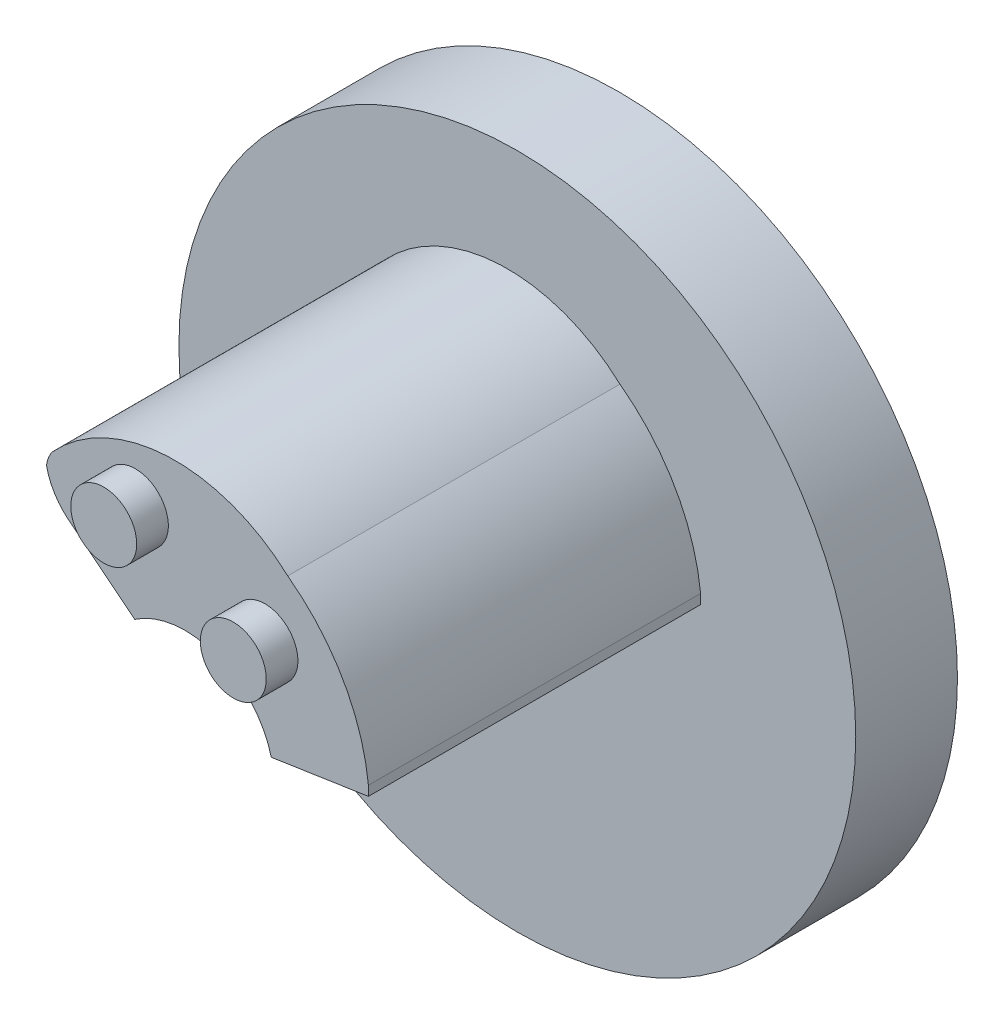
from build123d import *

# Parameters (mm, degrees)
BOSS_EXTRUDE1_DEPTH = 32.004
SKETCH5_R           = 3.175
BOSS_EXTRUDE2_DEPTH = 3.048
SKETCH7_R           = 32.60533467
BOSS_EXTRUDE3_DEPTH = 9.8
CUT_EXTRUDE5_START  = -35.052
SKETCH9_W           = 122.11276168
SKETCH9_H           = 106.51265785
CUT_EXTRUDE5_DEPTH  = 35.052
SKETCH10_R          = 8.5725
CUT_EXTRUDE6_DEPTH  = 61.354536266


with BuildPart() as part:
    # Sketch2 → Boss-Extrude1 (new body)
    with BuildSketch(Plane.XY):
        with BuildLine():
            Line((-4.995871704, 2.167139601), (-11.943893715, 7.729269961))
            ThreePointArc((-11.943893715, 7.729269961), (-13.875597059, 8.173422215), (-15.426585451, 6.939248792))
            ThreePointArc((-15.426585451, 6.939248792), (-17.782633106, -5.010209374), (-11.414108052, -15.392039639))
            ThreePointArc((-11.414108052, -15.392039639), (1.718555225, -19.37511194), (14.289299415, -13.869832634))
            ThreePointArc((14.289299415, -13.869832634), (19.942994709, -3.547221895), (19.361212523, 8.207866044))
            ThreePointArc((19.361212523, 8.207866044), (14.222372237, 15.915381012), (6.422091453, 20.912288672))
            ThreePointArc((6.422091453, 20.912288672), (-0.704799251, 21.876335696), (-7.787533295, 20.628603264))
            ThreePointArc((-7.787533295, 20.628603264), (-10.729764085, 15.799535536), (-8.451108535, 10.624176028))
            Line((-8.451108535, 10.624176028), (-2.109379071, 5.547403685))
            ThreePointArc((-2.109379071, 5.547403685), (9.262634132, -7.086001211), (-4.995871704, 2.167139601))
        make_face()
    extrude(amount=BOSS_EXTRUDE1_DEPTH)

    # Sketch5 → Boss-Extrude2 (add)
    with BuildSketch(Plane.XY.offset(32.004)):
        with Locations(Location((-2.051024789, 14.969020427, 0), (0, 0, 180))):
            Circle(SKETCH5_R)
        with Locations(Location((10.430271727, 9.94696029, 0), (0, 0, 180))):
            Circle(SKETCH5_R)
    boss_extrude2 = extrude(amount=BOSS_EXTRUDE2_DEPTH)

    # Sketch7 → Boss-Extrude3 (add)
    with BuildSketch(Plane(origin=(0, 0, 0), x_dir=(-1, 0, 0), z_dir=(0, 0, -1))):
        with Locations((-2.743553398, -1.51919399)):
            Circle(SKETCH7_R)
    extrude(amount=BOSS_EXTRUDE3_DEPTH)

    # Sketch9 → Cut-Extrude5 (cut)
    with BuildSketch(Plane.XY.offset(35.052).offset(CUT_EXTRUDE5_START)):
        Rectangle(SKETCH9_W, SKETCH9_H)
        with BuildLine():
            Line((-9.074701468, 11.123383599), (-9.95552853, 11.922756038))
            ThreePointArc((-9.95552853, 11.922756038), (-10.630899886, 13.730825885), (-10.039630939, 15.568118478))
            ThreePointArc((-10.039630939, 15.568118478), (1.093431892, 20.738118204), (12.628418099, 16.540728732))
            ThreePointArc((12.628418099, 16.540728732), (17.944646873, 10.572471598), (20.40061121, 2.966512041))
            Line((20.40061121, 2.966512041), (20.40061121, 2.03373442))
            Line((20.40061121, 2.03373442), (11.04565693, 0.616884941))
            ThreePointArc((11.04565693, 0.616884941), (5.752157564, 6.508013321), (-2.109379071, 5.547403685))
            Line((-2.109379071, 5.547403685), (-9.074701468, 11.123383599))
        make_face(mode=Mode.SUBTRACT)
    extrude(amount=CUT_EXTRUDE5_DEPTH, mode=Mode.SUBTRACT)

    # Sketch10 → Cut-Extrude6 (cut, through all)
    with BuildSketch(Plane.XY):
        with Locations(Location((2.743553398, -1.51919399, 0), (0, 0, 124.479038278))):
            Circle(SKETCH10_R)
    extrude(amount=-CUT_EXTRUDE6_DEPTH, mode=Mode.SUBTRACT)

    # Mirror1: Boss-Extrude2 across plane
    add(boss_extrude2.mirror(Plane.XY.offset(11.102)))


solid = part.part
